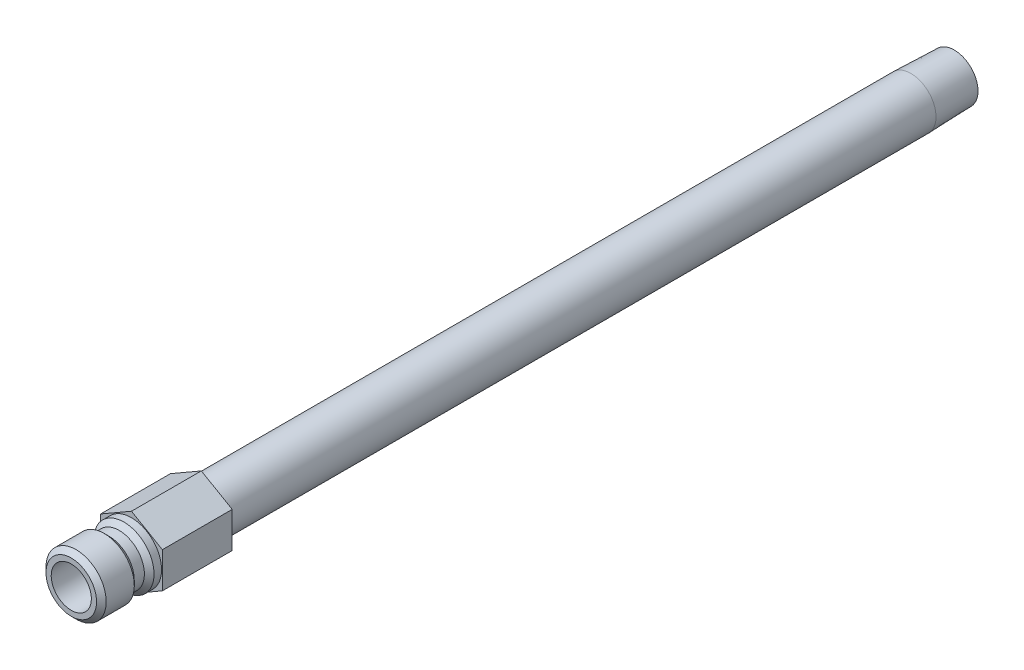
ISO-10303-21;
HEADER;
FILE_DESCRIPTION(('STEP AP214'),'2;1');
FILE_NAME('part.step','',(''),(''),'','','');
FILE_SCHEMA(('AUTOMOTIVE_DESIGN { 1 0 10303 214 1 1 1 1 }'));
ENDSEC;
DATA;
#1=APPLICATION_CONTEXT('core data for automotive mechanical design processes');
#2=APPLICATION_PROTOCOL_DEFINITION('international standard','automotive_design',2000,#1);
#3=PRODUCT_CONTEXT('',#1,'mechanical');
#4=PRODUCT('Part','Part','',(#3));
#5=PRODUCT_RELATED_PRODUCT_CATEGORY('part','',(#4));
#6=PRODUCT_DEFINITION_FORMATION('','',#4);
#7=PRODUCT_DEFINITION_CONTEXT('part definition',#1,'design');
#8=PRODUCT_DEFINITION('design','',#6,#7);
#9=PRODUCT_DEFINITION_SHAPE('','',#8);
#10=(LENGTH_UNIT() NAMED_UNIT(*) SI_UNIT(.MILLI.,.METRE.));
#11=(NAMED_UNIT(*) PLANE_ANGLE_UNIT() SI_UNIT($,.RADIAN.));
#12=(NAMED_UNIT(*) SI_UNIT($,.STERADIAN.) SOLID_ANGLE_UNIT());
#13=UNCERTAINTY_MEASURE_WITH_UNIT(LENGTH_MEASURE(1.E-05),#10,'distance_accuracy_value','');
#14=(GEOMETRIC_REPRESENTATION_CONTEXT(3) GLOBAL_UNCERTAINTY_ASSIGNED_CONTEXT((#13)) GLOBAL_UNIT_ASSIGNED_CONTEXT((#10,
#11,#12)) REPRESENTATION_CONTEXT('',''));
#15=CARTESIAN_POINT('',(0.,0.,0.));
#16=DIRECTION('',(0.,0.,1.));
#17=DIRECTION('',(1.,0.,0.));
#18=AXIS2_PLACEMENT_3D('',#15,#16,#17);
#19=CARTESIAN_POINT('',(0.,0.,0.));
#20=DIRECTION('',(0.,0.,-1.));
#21=DIRECTION('',(0.,1.,0.));
#22=AXIS2_PLACEMENT_3D('',#19,#20,#21);
#23=CYLINDRICAL_SURFACE('',#22,3.175);
#24=CARTESIAN_POINT('',(0.,0.,0.));
#25=DIRECTION('',(0.,0.,1.));
#26=DIRECTION('',(1.,0.,0.));
#27=AXIS2_PLACEMENT_3D('',#24,#25,#26);
#28=CIRCLE('',#27,3.175);
#29=CARTESIAN_POINT('',(3.175,0.,0.));
#30=VERTEX_POINT('',#29);
#31=EDGE_CURVE('E11',#30,#30,#28,.T.);
#32=ORIENTED_EDGE('',*,*,#31,.F.);
#33=EDGE_LOOP('',(#32));
#34=FACE_BOUND('',#33,.T.);
#35=CARTESIAN_POINT('',(0.,0.,9.525));
#36=DIRECTION('',(0.,0.,-1.));
#37=DIRECTION('',(0.,1.,0.));
#38=AXIS2_PLACEMENT_3D('',#35,#36,#37);
#39=CIRCLE('',#38,3.175);
#40=CARTESIAN_POINT('',(0.,3.175,9.525));
#41=VERTEX_POINT('',#40);
#42=EDGE_CURVE('E37',#41,#41,#39,.T.);
#43=ORIENTED_EDGE('',*,*,#42,.F.);
#44=EDGE_LOOP('',(#43));
#45=FACE_BOUND('',#44,.T.);
#46=ADVANCED_FACE('F34',(#34,#45),#23,.F.);
#47=CARTESIAN_POINT('',(0.,3.175,9.525));
#48=DIRECTION('',(0.,0.,1.));
#49=DIRECTION('',(0.,-1.,0.));
#50=AXIS2_PLACEMENT_3D('',#47,#48,#49);
#51=PLANE('',#50);
#52=ORIENTED_EDGE('',*,*,#42,.T.);
#53=EDGE_LOOP('',(#52));
#54=FACE_BOUND('',#53,.T.);
#55=CARTESIAN_POINT('',(0.,0.,9.525));
#56=DIRECTION('',(0.,0.,-1.));
#57=DIRECTION('',(0.,1.,0.));
#58=AXIS2_PLACEMENT_3D('',#55,#56,#57);
#59=CIRCLE('',#58,4.0005);
#60=CARTESIAN_POINT('',(0.,4.0005,9.525));
#61=VERTEX_POINT('',#60);
#62=EDGE_CURVE('E174',#61,#61,#59,.T.);
#63=ORIENTED_EDGE('',*,*,#62,.F.);
#64=EDGE_LOOP('',(#63));
#65=FACE_BOUND('',#64,.T.);
#66=ADVANCED_FACE('F181',(#54,#65),#51,.T.);
#67=CARTESIAN_POINT('',(0.,0.,8.763));
#68=DIRECTION('',(0.,0.,-1.));
#69=DIRECTION('',(0.,1.,0.));
#70=AXIS2_PLACEMENT_3D('',#67,#68,#69);
#71=CONICAL_SURFACE('',#70,4.7625,0.785398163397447);
#72=ORIENTED_EDGE('',*,*,#62,.T.);
#73=EDGE_LOOP('',(#72));
#74=FACE_BOUND('',#73,.T.);
#75=CARTESIAN_POINT('',(0.,0.,8.763));
#76=DIRECTION('',(0.,0.,-1.));
#77=DIRECTION('',(0.,1.,0.));
#78=AXIS2_PLACEMENT_3D('',#75,#76,#77);
#79=CIRCLE('',#78,4.7625);
#80=CARTESIAN_POINT('',(0.,4.7625,8.763));
#81=VERTEX_POINT('',#80);
#82=EDGE_CURVE('E172',#81,#81,#79,.T.);
#83=ORIENTED_EDGE('',*,*,#82,.F.);
#84=EDGE_LOOP('',(#83));
#85=FACE_BOUND('',#84,.T.);
#86=ADVANCED_FACE('F189',(#74,#85),#71,.T.);
#87=CARTESIAN_POINT('',(0.,0.,0.));
#88=DIRECTION('',(0.,0.,-1.));
#89=DIRECTION('',(0.,1.,0.));
#90=AXIS2_PLACEMENT_3D('',#87,#88,#89);
#91=CYLINDRICAL_SURFACE('',#90,4.7625);
#92=ORIENTED_EDGE('',*,*,#82,.T.);
#93=EDGE_LOOP('',(#92));
#94=FACE_BOUND('',#93,.T.);
#95=CARTESIAN_POINT('',(0.,0.,4.318));
#96=DIRECTION('',(0.,0.,-1.));
#97=DIRECTION('',(0.,1.,0.));
#98=AXIS2_PLACEMENT_3D('',#95,#96,#97);
#99=CIRCLE('',#98,4.7625);
#100=CARTESIAN_POINT('',(0.,4.7625,4.318));
#101=VERTEX_POINT('',#100);
#102=EDGE_CURVE('E169',#101,#101,#99,.T.);
#103=ORIENTED_EDGE('',*,*,#102,.F.);
#104=EDGE_LOOP('',(#103));
#105=FACE_BOUND('',#104,.T.);
#106=ADVANCED_FACE('F255',(#94,#105),#91,.T.);
#107=CARTESIAN_POINT('',(0.,0.,3.556));
#108=DIRECTION('',(0.,0.,1.));
#109=DIRECTION('',(0.,-1.,0.));
#110=AXIS2_PLACEMENT_3D('',#107,#108,#109);
#111=CONICAL_SURFACE('',#110,4.0005,0.785398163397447);
#112=ORIENTED_EDGE('',*,*,#102,.T.);
#113=EDGE_LOOP('',(#112));
#114=FACE_BOUND('',#113,.T.);
#115=CARTESIAN_POINT('',(0.,0.,3.556));
#116=DIRECTION('',(0.,0.,-1.));
#117=DIRECTION('',(0.,1.,0.));
#118=AXIS2_PLACEMENT_3D('',#115,#116,#117);
#119=CIRCLE('',#118,4.0005);
#120=CARTESIAN_POINT('',(0.,4.0005,3.556));
#121=VERTEX_POINT('',#120);
#122=EDGE_CURVE('E166',#121,#121,#119,.T.);
#123=ORIENTED_EDGE('',*,*,#122,.F.);
#124=EDGE_LOOP('',(#123));
#125=FACE_BOUND('',#124,.T.);
#126=ADVANCED_FACE('F251',(#114,#125),#111,.T.);
#127=CARTESIAN_POINT('',(0.,0.,0.));
#128=DIRECTION('',(0.,0.,-1.));
#129=DIRECTION('',(0.,1.,0.));
#130=AXIS2_PLACEMENT_3D('',#127,#128,#129);
#131=CYLINDRICAL_SURFACE('',#130,4.0005);
#132=ORIENTED_EDGE('',*,*,#122,.T.);
#133=EDGE_LOOP('',(#132));
#134=FACE_BOUND('',#133,.T.);
#135=CARTESIAN_POINT('',(0.,0.,1.9558));
#136=DIRECTION('',(0.,0.,-1.));
#137=DIRECTION('',(0.,1.,0.));
#138=AXIS2_PLACEMENT_3D('',#135,#136,#137);
#139=CIRCLE('',#138,4.0005);
#140=CARTESIAN_POINT('',(0.,4.0005,1.9558));
#141=VERTEX_POINT('',#140);
#142=EDGE_CURVE('E163',#141,#141,#139,.T.);
#143=ORIENTED_EDGE('',*,*,#142,.F.);
#144=EDGE_LOOP('',(#143));
#145=FACE_BOUND('',#144,.T.);
#146=ADVANCED_FACE('F247',(#134,#145),#131,.T.);
#147=CARTESIAN_POINT('',(0.,0.,1.1938));
#148=DIRECTION('',(0.,0.,-1.));
#149=DIRECTION('',(0.,1.,0.));
#150=AXIS2_PLACEMENT_3D('',#147,#148,#149);
#151=CONICAL_SURFACE('',#150,4.7625,0.785398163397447);
#152=ORIENTED_EDGE('',*,*,#142,.T.);
#153=EDGE_LOOP('',(#152));
#154=FACE_BOUND('',#153,.T.);
#155=CARTESIAN_POINT('',(0.,0.,1.1938));
#156=DIRECTION('',(0.,0.,-1.));
#157=DIRECTION('',(0.,1.,0.));
#158=AXIS2_PLACEMENT_3D('',#155,#156,#157);
#159=CIRCLE('',#158,4.7625);
#160=CARTESIAN_POINT('',(0.,4.7625,1.1938));
#161=VERTEX_POINT('',#160);
#162=EDGE_CURVE('E160',#161,#161,#159,.T.);
#163=ORIENTED_EDGE('',*,*,#162,.F.);
#164=EDGE_LOOP('',(#163));
#165=FACE_BOUND('',#164,.T.);
#166=ADVANCED_FACE('F243',(#154,#165),#151,.T.);
#167=CARTESIAN_POINT('',(0.,0.,0.));
#168=DIRECTION('',(0.,0.,-1.));
#169=DIRECTION('',(0.,1.,0.));
#170=AXIS2_PLACEMENT_3D('',#167,#168,#169);
#171=CYLINDRICAL_SURFACE('',#170,4.7625);
#172=ORIENTED_EDGE('',*,*,#162,.T.);
#173=EDGE_LOOP('',(#172));
#174=FACE_BOUND('',#173,.T.);
#175=CARTESIAN_POINT('',(0.,0.,0.));
#176=DIRECTION('',(0.,0.,-1.));
#177=DIRECTION('',(0.,1.,0.));
#178=AXIS2_PLACEMENT_3D('',#175,#176,#177);
#179=CIRCLE('',#178,4.7625);
#180=CARTESIAN_POINT('',(0.,4.7625,0.));
#181=VERTEX_POINT('',#180);
#182=EDGE_CURVE('E157',#181,#181,#179,.T.);
#183=ORIENTED_EDGE('',*,*,#182,.F.);
#184=EDGE_LOOP('',(#183));
#185=FACE_BOUND('',#184,.T.);
#186=ADVANCED_FACE('F196',(#174,#185),#171,.T.);
#187=CARTESIAN_POINT('',(-4.8895,2.82295414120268,0.));
#188=DIRECTION('',(0.,0.,1.));
#189=DIRECTION('',(1.,0.,0.));
#190=AXIS2_PLACEMENT_3D('',#187,#188,#189);
#191=PLANE('',#190);
#192=ORIENTED_EDGE('',*,*,#31,.T.);
#193=EDGE_LOOP('',(#192));
#194=FACE_BOUND('',#193,.T.);
#195=CARTESIAN_POINT('',(0.,0.,0.));
#196=DIRECTION('',(0.,0.,1.));
#197=DIRECTION('',(1.,0.,0.));
#198=AXIS2_PLACEMENT_3D('',#195,#196,#197);
#199=CIRCLE('',#198,2.38124999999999);
#200=CARTESIAN_POINT('',(2.38124999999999,0.,0.));
#201=VERTEX_POINT('',#200);
#202=EDGE_CURVE('E126',#201,#201,#199,.T.);
#203=ORIENTED_EDGE('',*,*,#202,.F.);
#204=EDGE_LOOP('',(#203));
#205=FACE_BOUND('',#204,.T.);
#206=ADVANCED_FACE('F192',(#194,#205),#191,.T.);
#207=CARTESIAN_POINT('',(0.,0.,-130.175));
#208=DIRECTION('',(0.,0.,1.));
#209=DIRECTION('',(0.,-1.,0.));
#210=AXIS2_PLACEMENT_3D('',#207,#208,#209);
#211=CONICAL_SURFACE('',#210,3.75443877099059,0.0312396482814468);
#212=CARTESIAN_POINT('',(0.,0.,-123.317));
#213=DIRECTION('',(0.,0.,-1.));
#214=DIRECTION('',(0.,1.,0.));
#215=AXIS2_PLACEMENT_3D('',#212,#213,#214);
#216=CIRCLE('',#215,3.96874999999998);
#217=CARTESIAN_POINT('',(0.,3.96875,-123.317));
#218=VERTEX_POINT('',#217);
#219=EDGE_CURVE('E154',#218,#218,#216,.T.);
#220=ORIENTED_EDGE('',*,*,#219,.T.);
#221=EDGE_LOOP('',(#220));
#222=FACE_BOUND('',#221,.T.);
#223=CARTESIAN_POINT('',(0.,0.,-130.175));
#224=DIRECTION('',(0.,0.,-1.));
#225=DIRECTION('',(0.,1.,0.));
#226=AXIS2_PLACEMENT_3D('',#223,#224,#225);
#227=CIRCLE('',#226,3.75443877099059);
#228=CARTESIAN_POINT('',(0.,3.7544387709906,-130.175));
#229=VERTEX_POINT('',#228);
#230=EDGE_CURVE('E151',#229,#229,#227,.T.);
#231=ORIENTED_EDGE('',*,*,#230,.F.);
#232=EDGE_LOOP('',(#231));
#233=FACE_BOUND('',#232,.T.);
#234=ADVANCED_FACE('F195',(#222,#233),#211,.T.);
#235=CARTESIAN_POINT('',(0.,0.,0.));
#236=DIRECTION('',(0.,0.,-1.));
#237=DIRECTION('',(0.,1.,0.));
#238=AXIS2_PLACEMENT_3D('',#235,#236,#237);
#239=CYLINDRICAL_SURFACE('',#238,3.96874999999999);
#240=ORIENTED_EDGE('',*,*,#219,.F.);
#241=EDGE_LOOP('',(#240));
#242=FACE_BOUND('',#241,.T.);
#243=CARTESIAN_POINT('',(0.,0.,-11.049));
#244=DIRECTION('',(0.,0.,1.));
#245=DIRECTION('',(1.,0.,0.));
#246=AXIS2_PLACEMENT_3D('',#243,#244,#245);
#247=CIRCLE('',#246,3.96874999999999);
#248=CARTESIAN_POINT('',(3.96874999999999,0.,-11.049));
#249=VERTEX_POINT('',#248);
#250=EDGE_CURVE('E140',#249,#249,#247,.F.);
#251=ORIENTED_EDGE('',*,*,#250,.T.);
#252=EDGE_LOOP('',(#251));
#253=FACE_BOUND('',#252,.T.);
#254=ADVANCED_FACE('F233',(#242,#253),#239,.T.);
#255=CARTESIAN_POINT('',(0.,3.7544387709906,-130.175));
#256=DIRECTION('',(0.,0.,-1.));
#257=DIRECTION('',(0.,1.,0.));
#258=AXIS2_PLACEMENT_3D('',#255,#256,#257);
#259=PLANE('',#258);
#260=ORIENTED_EDGE('',*,*,#230,.T.);
#261=EDGE_LOOP('',(#260));
#262=FACE_BOUND('',#261,.T.);
#263=CARTESIAN_POINT('',(0.,0.,-130.175));
#264=DIRECTION('',(0.,0.,-1.));
#265=DIRECTION('',(0.,1.,0.));
#266=AXIS2_PLACEMENT_3D('',#263,#264,#265);
#267=CIRCLE('',#266,2.38124999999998);
#268=CARTESIAN_POINT('',(0.,2.38125,-130.175));
#269=VERTEX_POINT('',#268);
#270=EDGE_CURVE('E147',#269,#269,#267,.T.);
#271=ORIENTED_EDGE('',*,*,#270,.F.);
#272=EDGE_LOOP('',(#271));
#273=FACE_BOUND('',#272,.T.);
#274=ADVANCED_FACE('F230',(#262,#273),#259,.T.);
#275=CARTESIAN_POINT('',(0.,0.,0.));
#276=DIRECTION('',(0.,0.,-1.));
#277=DIRECTION('',(0.,1.,0.));
#278=AXIS2_PLACEMENT_3D('',#275,#276,#277);
#279=CYLINDRICAL_SURFACE('',#278,2.38124999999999);
#280=ORIENTED_EDGE('',*,*,#202,.T.);
#281=EDGE_LOOP('',(#280));
#282=FACE_BOUND('',#281,.T.);
#283=ORIENTED_EDGE('',*,*,#270,.T.);
#284=EDGE_LOOP('',(#283));
#285=FACE_BOUND('',#284,.T.);
#286=ADVANCED_FACE('F216',(#282,#285),#279,.F.);
#287=CARTESIAN_POINT('',(0.,5.64590828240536,-11.049));
#288=DIRECTION('',(-0.5,0.866025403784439,0.));
#289=DIRECTION('',(-0.866025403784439,-0.5,0.));
#290=AXIS2_PLACEMENT_3D('',#287,#288,#289);
#291=PLANE('',#290);
#292=DIRECTION('',(-0.866025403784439,-0.5,0.));
#293=VECTOR('',#292,1.);
#294=CARTESIAN_POINT('',(0.,5.64590828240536,0.));
#295=LINE('',#294,#293);
#296=CARTESIAN_POINT('',(0.,5.64590828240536,0.));
#297=VERTEX_POINT('',#296);
#298=CARTESIAN_POINT('',(-4.8895,2.82295414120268,0.));
#299=VERTEX_POINT('',#298);
#300=EDGE_CURVE('E122',#297,#299,#295,.T.);
#301=ORIENTED_EDGE('',*,*,#300,.F.);
#302=DIRECTION('',(0.,0.,1.));
#303=VECTOR('',#302,1.);
#304=CARTESIAN_POINT('',(0.,5.64590828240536,-11.049));
#305=LINE('',#304,#303);
#306=CARTESIAN_POINT('',(0.,5.64590828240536,-11.049));
#307=VERTEX_POINT('',#306);
#308=EDGE_CURVE('E51',#307,#297,#305,.T.);
#309=ORIENTED_EDGE('',*,*,#308,.F.);
#310=DIRECTION('',(-0.866025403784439,-0.5,0.));
#311=VECTOR('',#310,1.);
#312=CARTESIAN_POINT('',(0.,5.64590828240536,-11.049));
#313=LINE('',#312,#311);
#314=CARTESIAN_POINT('',(-4.8895,2.82295414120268,-11.049));
#315=VERTEX_POINT('',#314);
#316=EDGE_CURVE('E138',#307,#315,#313,.T.);
#317=ORIENTED_EDGE('',*,*,#316,.T.);
#318=DIRECTION('',(0.,0.,1.));
#319=VECTOR('',#318,1.);
#320=CARTESIAN_POINT('',(-4.8895,2.82295414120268,-11.049));
#321=LINE('',#320,#319);
#322=EDGE_CURVE('E86',#315,#299,#321,.T.);
#323=ORIENTED_EDGE('',*,*,#322,.T.);
#324=EDGE_LOOP('',(#301,#309,#317,#323));
#325=FACE_BOUND('',#324,.T.);
#326=ADVANCED_FACE('F206',(#325),#291,.T.);
#327=CARTESIAN_POINT('',(4.8895,2.82295414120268,-11.049));
#328=DIRECTION('',(0.5,0.866025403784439,0.));
#329=DIRECTION('',(-0.866025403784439,0.5,0.));
#330=AXIS2_PLACEMENT_3D('',#327,#328,#329);
#331=PLANE('',#330);
#332=DIRECTION('',(-0.866025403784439,0.5,0.));
#333=VECTOR('',#332,1.);
#334=CARTESIAN_POINT('',(4.8895,2.82295414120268,0.));
#335=LINE('',#334,#333);
#336=CARTESIAN_POINT('',(4.8895,2.82295414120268,0.));
#337=VERTEX_POINT('',#336);
#338=EDGE_CURVE('E135',#337,#297,#335,.T.);
#339=ORIENTED_EDGE('',*,*,#338,.F.);
#340=DIRECTION('',(0.,0.,1.));
#341=VECTOR('',#340,1.);
#342=CARTESIAN_POINT('',(4.8895,2.82295414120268,-11.049));
#343=LINE('',#342,#341);
#344=CARTESIAN_POINT('',(4.8895,2.82295414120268,-11.049));
#345=VERTEX_POINT('',#344);
#346=EDGE_CURVE('E74',#345,#337,#343,.T.);
#347=ORIENTED_EDGE('',*,*,#346,.F.);
#348=DIRECTION('',(-0.866025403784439,0.5,0.));
#349=VECTOR('',#348,1.);
#350=CARTESIAN_POINT('',(4.8895,2.82295414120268,-11.049));
#351=LINE('',#350,#349);
#352=EDGE_CURVE('E112',#345,#307,#351,.T.);
#353=ORIENTED_EDGE('',*,*,#352,.T.);
#354=ORIENTED_EDGE('',*,*,#308,.T.);
#355=EDGE_LOOP('',(#339,#347,#353,#354));
#356=FACE_BOUND('',#355,.T.);
#357=ADVANCED_FACE('F208',(#356),#331,.T.);
#358=CARTESIAN_POINT('',(4.8895,-2.82295414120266,-11.049));
#359=DIRECTION('',(1.,0.,0.));
#360=DIRECTION('',(0.,0.,-1.));
#361=AXIS2_PLACEMENT_3D('',#358,#359,#360);
#362=PLANE('',#361);
#363=DIRECTION('',(0.,1.,0.));
#364=VECTOR('',#363,1.);
#365=CARTESIAN_POINT('',(4.8895,-2.82295414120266,0.));
#366=LINE('',#365,#364);
#367=CARTESIAN_POINT('',(4.8895,-2.82295414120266,0.));
#368=VERTEX_POINT('',#367);
#369=EDGE_CURVE('E99',#368,#337,#366,.T.);
#370=ORIENTED_EDGE('',*,*,#369,.F.);
#371=DIRECTION('',(0.,0.,1.));
#372=VECTOR('',#371,1.);
#373=CARTESIAN_POINT('',(4.8895,-2.82295414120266,-11.049));
#374=LINE('',#373,#372);
#375=CARTESIAN_POINT('',(4.8895,-2.82295414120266,-11.049));
#376=VERTEX_POINT('',#375);
#377=EDGE_CURVE('E94',#376,#368,#374,.T.);
#378=ORIENTED_EDGE('',*,*,#377,.F.);
#379=DIRECTION('',(0.,1.,0.));
#380=VECTOR('',#379,1.);
#381=CARTESIAN_POINT('',(4.8895,-2.82295414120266,-11.049));
#382=LINE('',#381,#380);
#383=EDGE_CURVE('E97',#376,#345,#382,.T.);
#384=ORIENTED_EDGE('',*,*,#383,.T.);
#385=ORIENTED_EDGE('',*,*,#346,.T.);
#386=EDGE_LOOP('',(#370,#378,#384,#385));
#387=FACE_BOUND('',#386,.T.);
#388=ADVANCED_FACE('F96',(#387),#362,.T.);
#389=CARTESIAN_POINT('',(0.,-5.64590828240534,-11.049));
#390=DIRECTION('',(0.5,-0.866025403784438,0.));
#391=DIRECTION('',(0.866025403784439,0.5,0.));
#392=AXIS2_PLACEMENT_3D('',#389,#390,#391);
#393=PLANE('',#392);
#394=DIRECTION('',(0.866025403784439,0.5,0.));
#395=VECTOR('',#394,1.);
#396=CARTESIAN_POINT('',(0.,-5.64590828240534,0.));
#397=LINE('',#396,#395);
#398=CARTESIAN_POINT('',(0.,-5.64590828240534,0.));
#399=VERTEX_POINT('',#398);
#400=EDGE_CURVE('E132',#399,#368,#397,.T.);
#401=ORIENTED_EDGE('',*,*,#400,.F.);
#402=DIRECTION('',(0.,0.,1.));
#403=VECTOR('',#402,1.);
#404=CARTESIAN_POINT('',(0.,-5.64590828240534,-11.049));
#405=LINE('',#404,#403);
#406=CARTESIAN_POINT('',(0.,-5.64590828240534,-11.049));
#407=VERTEX_POINT('',#406);
#408=EDGE_CURVE('E104',#407,#399,#405,.T.);
#409=ORIENTED_EDGE('',*,*,#408,.F.);
#410=DIRECTION('',(0.866025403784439,0.5,0.));
#411=VECTOR('',#410,1.);
#412=CARTESIAN_POINT('',(0.,-5.64590828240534,-11.049));
#413=LINE('',#412,#411);
#414=EDGE_CURVE('E110',#407,#376,#413,.T.);
#415=ORIENTED_EDGE('',*,*,#414,.T.);
#416=ORIENTED_EDGE('',*,*,#377,.T.);
#417=EDGE_LOOP('',(#401,#409,#415,#416));
#418=FACE_BOUND('',#417,.T.);
#419=ADVANCED_FACE('F114',(#418),#393,.T.);
#420=CARTESIAN_POINT('',(-4.8895,-2.82295414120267,-11.049));
#421=DIRECTION('',(-0.5,-0.866025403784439,0.));
#422=DIRECTION('',(0.866025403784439,-0.5,0.));
#423=AXIS2_PLACEMENT_3D('',#420,#421,#422);
#424=PLANE('',#423);
#425=DIRECTION('',(0.866025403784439,-0.5,0.));
#426=VECTOR('',#425,1.);
#427=CARTESIAN_POINT('',(-4.8895,-2.82295414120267,0.));
#428=LINE('',#427,#426);
#429=CARTESIAN_POINT('',(-4.8895,-2.82295414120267,0.));
#430=VERTEX_POINT('',#429);
#431=EDGE_CURVE('E129',#430,#399,#428,.T.);
#432=ORIENTED_EDGE('',*,*,#431,.F.);
#433=DIRECTION('',(0.,0.,1.));
#434=VECTOR('',#433,1.);
#435=CARTESIAN_POINT('',(-4.8895,-2.82295414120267,-11.049));
#436=LINE('',#435,#434);
#437=CARTESIAN_POINT('',(-4.8895,-2.82295414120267,-11.049));
#438=VERTEX_POINT('',#437);
#439=EDGE_CURVE('E143',#438,#430,#436,.T.);
#440=ORIENTED_EDGE('',*,*,#439,.F.);
#441=DIRECTION('',(0.866025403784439,-0.5,0.));
#442=VECTOR('',#441,1.);
#443=CARTESIAN_POINT('',(-4.8895,-2.82295414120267,-11.049));
#444=LINE('',#443,#442);
#445=EDGE_CURVE('E115',#438,#407,#444,.T.);
#446=ORIENTED_EDGE('',*,*,#445,.T.);
#447=ORIENTED_EDGE('',*,*,#408,.T.);
#448=EDGE_LOOP('',(#432,#440,#446,#447));
#449=FACE_BOUND('',#448,.T.);
#450=ADVANCED_FACE('F222',(#449),#424,.T.);
#451=CARTESIAN_POINT('',(-4.8895,2.82295414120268,-11.049));
#452=DIRECTION('',(-1.,0.,0.));
#453=DIRECTION('',(0.,0.,1.));
#454=AXIS2_PLACEMENT_3D('',#451,#452,#453);
#455=PLANE('',#454);
#456=DIRECTION('',(0.,-1.,0.));
#457=VECTOR('',#456,1.);
#458=CARTESIAN_POINT('',(-4.8895,2.82295414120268,0.));
#459=LINE('',#458,#457);
#460=EDGE_CURVE('E125',#299,#430,#459,.T.);
#461=ORIENTED_EDGE('',*,*,#460,.F.);
#462=ORIENTED_EDGE('',*,*,#322,.F.);
#463=DIRECTION('',(0.,-1.,0.));
#464=VECTOR('',#463,1.);
#465=CARTESIAN_POINT('',(-4.8895,2.82295414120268,-11.049));
#466=LINE('',#465,#464);
#467=EDGE_CURVE('E117',#315,#438,#466,.T.);
#468=ORIENTED_EDGE('',*,*,#467,.T.);
#469=ORIENTED_EDGE('',*,*,#439,.T.);
#470=EDGE_LOOP('',(#461,#462,#468,#469));
#471=FACE_BOUND('',#470,.T.);
#472=ADVANCED_FACE('F204',(#471),#455,.T.);
#473=CARTESIAN_POINT('',(-4.8895,2.82295414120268,-11.049));
#474=DIRECTION('',(0.,0.,1.));
#475=DIRECTION('',(1.,0.,0.));
#476=AXIS2_PLACEMENT_3D('',#473,#474,#475);
#477=PLANE('',#476);
#478=ORIENTED_EDGE('',*,*,#250,.F.);
#479=EDGE_LOOP('',(#478));
#480=FACE_BOUND('',#479,.T.);
#481=ORIENTED_EDGE('',*,*,#316,.F.);
#482=ORIENTED_EDGE('',*,*,#352,.F.);
#483=ORIENTED_EDGE('',*,*,#383,.F.);
#484=ORIENTED_EDGE('',*,*,#414,.F.);
#485=ORIENTED_EDGE('',*,*,#445,.F.);
#486=ORIENTED_EDGE('',*,*,#467,.F.);
#487=EDGE_LOOP('',(#481,#482,#483,#484,#485,#486));
#488=FACE_BOUND('',#487,.T.);
#489=ADVANCED_FACE('F108',(#480,#488),#477,.F.);
#490=ORIENTED_EDGE('',*,*,#182,.T.);
#491=EDGE_LOOP('',(#490));
#492=FACE_BOUND('',#491,.T.);
#493=ORIENTED_EDGE('',*,*,#300,.T.);
#494=ORIENTED_EDGE('',*,*,#460,.T.);
#495=ORIENTED_EDGE('',*,*,#431,.T.);
#496=ORIENTED_EDGE('',*,*,#400,.T.);
#497=ORIENTED_EDGE('',*,*,#369,.T.);
#498=ORIENTED_EDGE('',*,*,#338,.T.);
#499=EDGE_LOOP('',(#493,#494,#495,#496,#497,#498));
#500=FACE_BOUND('',#499,.T.);
#501=ADVANCED_FACE('F198',(#492,#500),#191,.T.);
#502=CLOSED_SHELL('',(#46,#66,#86,#106,#126,#146,#166,#186,#206,#234,#254,#274,#286,#326,#357,
#388,#419,#450,#472,#489,#501));
#503=MANIFOLD_SOLID_BREP('B2',#502);
#504=ADVANCED_BREP_SHAPE_REPRESENTATION('',(#18,#503),#14);
#505=SHAPE_DEFINITION_REPRESENTATION(#9,#504);
ENDSEC;
END-ISO-10303-21;
